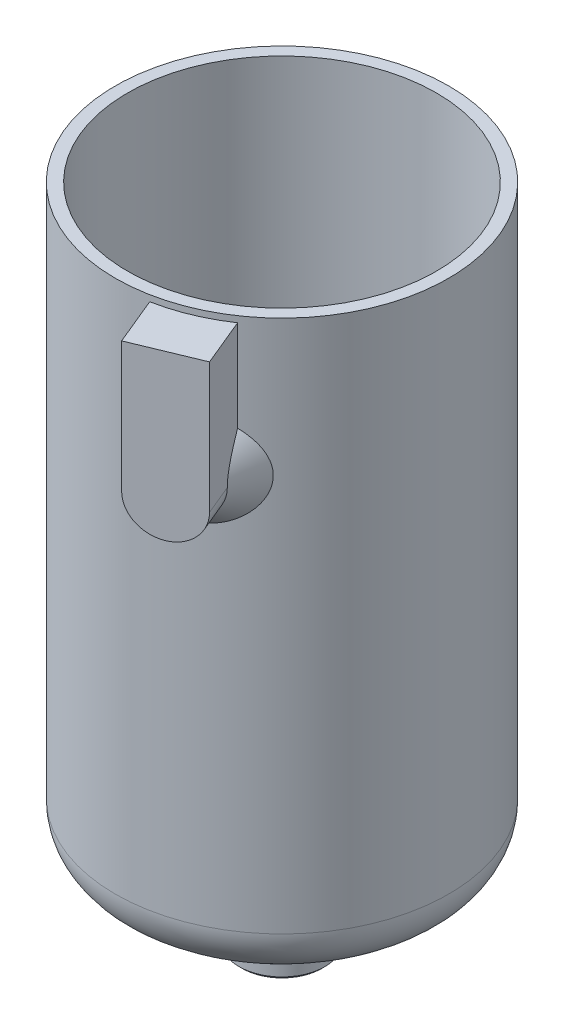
from build123d import *

# Parameters (mm, degrees)
EXTRUDE_1_DEPTH      = 5
EXTRUDE_1_DEPTH_BACK = 5


with BuildPart() as part:
    # Sketch 1 → Revolve 1 (revolve)
    with BuildSketch(Plane.XY, mode=Mode.PRIVATE) as revolve_1_sk:
        with BuildLine():
            Line((0, -92.1), (-5, -92.1))
            Line((-5, -92.1), (-5, -108.1))
            Line((-5, -108.1), (-6.5, -108.1))
            Line((-6.5, -108.1), (-7, -107.6))
            Line((-7, -107.6), (-7, -102.1))
            Line((-7, -102.1), (-7.75, -101.35))
            Line((-7.75, -101.35), (-7.75, -96.9))
            Line((-7.75, -96.9), (-10.3, -96.9))
            Line((-10.3, -96.9), (-10.8, -96.4))
            Line((-10.8, -96.4), (-10.8, -87.946427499))
            ThreePointArc((-10.8, -87.946427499), (-13.340481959, -86.984092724), (-15.196152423, -85))
            Line((-15.196152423, -85), (-16, -85))
            Line((-16, -85), (-16, -95.4))
            Line((-16, -95.4), (-19.05, -95.4))
            ThreePointArc((-19.05, -95.4), (-24.848275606, -92.998275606), (-27.25, -87.2))
            Line((-27.25, -87.2), (-27.25, 0))
            Line((-27.25, 0), (0, 0))
            Line((0, 0), (0, -92.1))
        make_face()
    revolve(revolve_1_sk.sketch.rotate(Axis((0, 0, 0), (0, -1, 0)), 90), axis=Axis((0, 0, 0), (0, -1, 0)))

    # Sketch 2 → Revolve 2 (revolve)
    with BuildSketch(Plane(origin=(0, -22.3, 0), x_dir=(1, 0, 0), z_dir=(0, 1, 0)), mode=Mode.PRIVATE) as revolve_2_sk:
        Polygon((11.403966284, -27.531610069), (6.322628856, -29.636368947), (0.328290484, -26.923822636), (-0.819759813, -24.152184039), (8.419035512, -20.325349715), align=None)
    revolve(revolve_2_sk.sketch.rotate(Axis((8.419035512, -22.3, 20.325349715), (0.3826834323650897, 0, 0.9238795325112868)), 34.948932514), axis=Axis((8.419035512, -22.3, 20.325349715), (0.3826834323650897, 0, 0.9238795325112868)))

    # Sketch 3 → Extrude 1 (add, two sides: drawn at the far end of the back side and taken through both)
    with BuildSketch(Plane(origin=(11.545559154, 0, 27.873445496), x_dir=(0.9238795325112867, 0, -0.38268343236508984), z_dir=(0.38268343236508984, 0, 0.9238795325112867)).offset(-EXTRUDE_1_DEPTH_BACK)):
        with BuildLine():
            Line((-5.5, -1), (-5.5, -22.3))
            ThreePointArc((-5.5, -22.3), (0, -27.8), (5.5, -22.3))
            Line((5.5, -22.3), (5.5, -1))
            Line((5.5, -1), (-5.5, -1))
        make_face()
    extrude(amount=EXTRUDE_1_DEPTH + EXTRUDE_1_DEPTH_BACK)

    # Sketch 4 → Cut-Revolve 1 (revolve, cut)
    with BuildSketch(Plane.XY, mode=Mode.PRIVATE) as cut_revolve_1_sk:
        with BuildLine():
            Line((0, -83), (-18, -83))
            Line((-18, -83), (-18, -93.364766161))
            ThreePointArc((-18, -93.364766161), (-23.166079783, -90.785164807), (-25.25, -85.4))
            Line((-25.25, -85.4), (-25.25, 0))
            Line((-25.25, 0), (0, 0))
            Line((0, 0), (0, -83))
        make_face()
    revolve(cut_revolve_1_sk.sketch.rotate(Axis((0, 0, 0), (0, -1, 0)), 90), axis=Axis((0, 0, 0), (0, -1, 0)), mode=Mode.SUBTRACT)


solid = part.part
